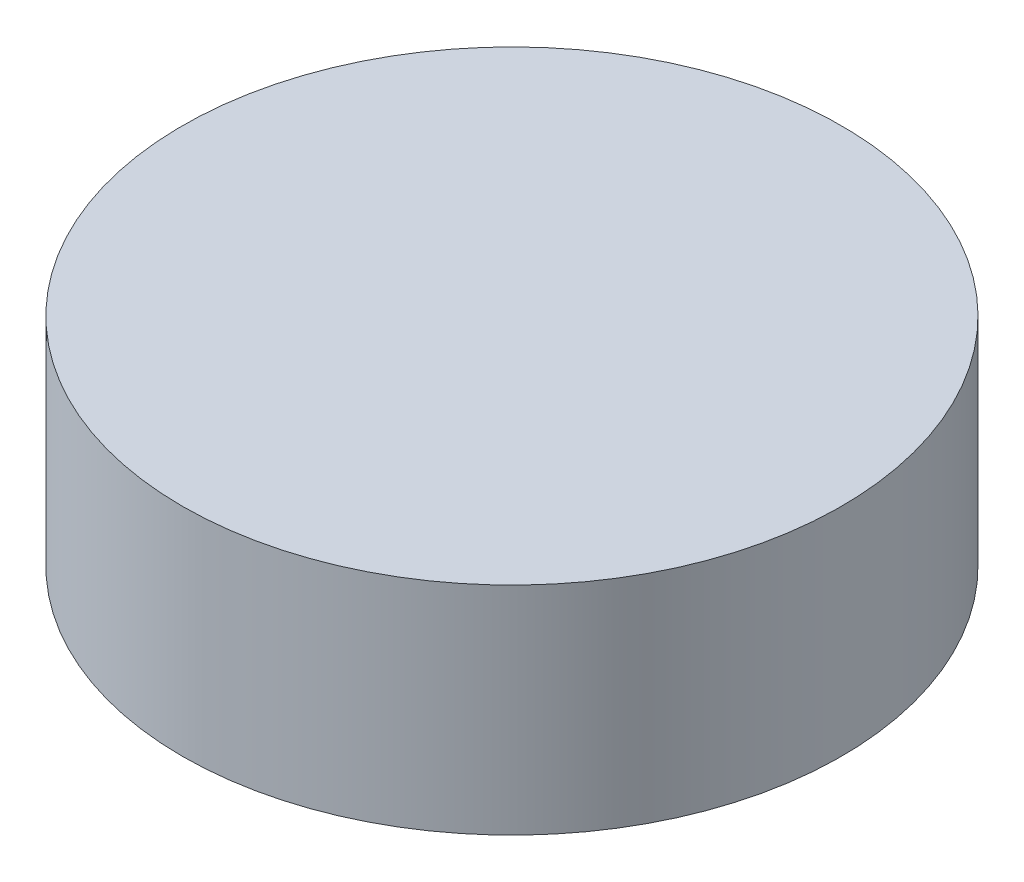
ISO-10303-21;
HEADER;
FILE_DESCRIPTION(('STEP AP214'),'2;1');
FILE_NAME('part.step','',(''),(''),'','','');
FILE_SCHEMA(('AUTOMOTIVE_DESIGN { 1 0 10303 214 1 1 1 1 }'));
ENDSEC;
DATA;
#1=APPLICATION_CONTEXT('core data for automotive mechanical design processes');
#2=APPLICATION_PROTOCOL_DEFINITION('international standard','automotive_design',2000,#1);
#3=PRODUCT_CONTEXT('',#1,'mechanical');
#4=PRODUCT('Part','Part','',(#3));
#5=PRODUCT_RELATED_PRODUCT_CATEGORY('part','',(#4));
#6=PRODUCT_DEFINITION_FORMATION('','',#4);
#7=PRODUCT_DEFINITION_CONTEXT('part definition',#1,'design');
#8=PRODUCT_DEFINITION('design','',#6,#7);
#9=PRODUCT_DEFINITION_SHAPE('','',#8);
#10=(LENGTH_UNIT() NAMED_UNIT(*) SI_UNIT(.MILLI.,.METRE.));
#11=(NAMED_UNIT(*) PLANE_ANGLE_UNIT() SI_UNIT($,.RADIAN.));
#12=(NAMED_UNIT(*) SI_UNIT($,.STERADIAN.) SOLID_ANGLE_UNIT());
#13=UNCERTAINTY_MEASURE_WITH_UNIT(LENGTH_MEASURE(1.E-05),#10,'distance_accuracy_value','');
#14=(GEOMETRIC_REPRESENTATION_CONTEXT(3) GLOBAL_UNCERTAINTY_ASSIGNED_CONTEXT((#13)) GLOBAL_UNIT_ASSIGNED_CONTEXT((#10,
#11,#12)) REPRESENTATION_CONTEXT('',''));
#15=CARTESIAN_POINT('',(0.,0.,0.));
#16=DIRECTION('',(0.,0.,1.));
#17=DIRECTION('',(1.,0.,0.));
#18=AXIS2_PLACEMENT_3D('',#15,#16,#17);
#19=CARTESIAN_POINT('',(0.,-2.921,0.));
#20=DIRECTION('',(0.,1.,0.));
#21=DIRECTION('',(0.,0.,1.));
#22=AXIS2_PLACEMENT_3D('',#19,#20,#21);
#23=CYLINDRICAL_SURFACE('',#22,8.89);
#24=CARTESIAN_POINT('',(0.,-2.921,0.));
#25=DIRECTION('',(0.,1.,0.));
#26=DIRECTION('',(0.,0.,1.));
#27=AXIS2_PLACEMENT_3D('',#24,#25,#26);
#28=CIRCLE('',#27,8.89);
#29=CARTESIAN_POINT('',(0.,-2.921,8.89));
#30=VERTEX_POINT('',#29);
#31=EDGE_CURVE('E10',#30,#30,#28,.T.);
#32=ORIENTED_EDGE('',*,*,#31,.T.);
#33=EDGE_LOOP('',(#32));
#34=FACE_BOUND('',#33,.T.);
#35=CARTESIAN_POINT('',(0.,2.921,0.));
#36=DIRECTION('',(0.,1.,0.));
#37=DIRECTION('',(0.,0.,1.));
#38=AXIS2_PLACEMENT_3D('',#35,#36,#37);
#39=CIRCLE('',#38,8.89);
#40=CARTESIAN_POINT('',(0.,2.921,8.89));
#41=VERTEX_POINT('',#40);
#42=EDGE_CURVE('E43',#41,#41,#39,.T.);
#43=ORIENTED_EDGE('',*,*,#42,.F.);
#44=EDGE_LOOP('',(#43));
#45=FACE_BOUND('',#44,.T.);
#46=ADVANCED_FACE('F40',(#34,#45),#23,.T.);
#47=CARTESIAN_POINT('',(0.,-2.921,0.));
#48=DIRECTION('',(0.,1.,0.));
#49=DIRECTION('',(0.,0.,1.));
#50=AXIS2_PLACEMENT_3D('',#47,#48,#49);
#51=PLANE('',#50);
#52=CARTESIAN_POINT('',(0.,-2.921,0.));
#53=DIRECTION('',(0.,-1.,0.));
#54=DIRECTION('',(0.,0.,-1.));
#55=AXIS2_PLACEMENT_3D('',#52,#53,#54);
#56=CIRCLE('',#55,3.81);
#57=CARTESIAN_POINT('',(0.,-2.921,-3.81));
#58=VERTEX_POINT('',#57);
#59=EDGE_CURVE('E54',#58,#58,#56,.T.);
#60=ORIENTED_EDGE('',*,*,#59,.F.);
#61=EDGE_LOOP('',(#60));
#62=FACE_BOUND('',#61,.T.);
#63=ORIENTED_EDGE('',*,*,#31,.F.);
#64=EDGE_LOOP('',(#63));
#65=FACE_BOUND('',#64,.T.);
#66=ADVANCED_FACE('F71',(#62,#65),#51,.F.);
#67=CARTESIAN_POINT('',(0.,2.921,0.));
#68=DIRECTION('',(0.,1.,0.));
#69=DIRECTION('',(0.,0.,1.));
#70=AXIS2_PLACEMENT_3D('',#67,#68,#69);
#71=PLANE('',#70);
#72=ORIENTED_EDGE('',*,*,#42,.T.);
#73=EDGE_LOOP('',(#72));
#74=FACE_BOUND('',#73,.T.);
#75=ADVANCED_FACE('F67',(#74),#71,.T.);
#76=CARTESIAN_POINT('',(0.,2.159,0.));
#77=DIRECTION('',(0.,-1.,0.));
#78=DIRECTION('',(0.,0.,-1.));
#79=AXIS2_PLACEMENT_3D('',#76,#77,#78);
#80=CYLINDRICAL_SURFACE('',#79,3.81);
#81=CARTESIAN_POINT('',(0.,2.159,0.));
#82=DIRECTION('',(0.,-1.,0.));
#83=DIRECTION('',(0.,0.,-1.));
#84=AXIS2_PLACEMENT_3D('',#81,#82,#83);
#85=CIRCLE('',#84,3.81);
#86=CARTESIAN_POINT('',(0.,2.159,-3.81));
#87=VERTEX_POINT('',#86);
#88=EDGE_CURVE('E52',#87,#87,#85,.T.);
#89=ORIENTED_EDGE('',*,*,#88,.F.);
#90=EDGE_LOOP('',(#89));
#91=FACE_BOUND('',#90,.T.);
#92=ORIENTED_EDGE('',*,*,#59,.T.);
#93=EDGE_LOOP('',(#92));
#94=FACE_BOUND('',#93,.T.);
#95=ADVANCED_FACE('F64',(#91,#94),#80,.F.);
#96=CARTESIAN_POINT('',(0.,2.159,0.));
#97=DIRECTION('',(0.,-1.,0.));
#98=DIRECTION('',(0.,0.,-1.));
#99=AXIS2_PLACEMENT_3D('',#96,#97,#98);
#100=PLANE('',#99);
#101=ORIENTED_EDGE('',*,*,#88,.T.);
#102=EDGE_LOOP('',(#101));
#103=FACE_BOUND('',#102,.T.);
#104=ADVANCED_FACE('F62',(#103),#100,.T.);
#105=CLOSED_SHELL('',(#46,#66,#75,#95,#104));
#106=MANIFOLD_SOLID_BREP('B2',#105);
#107=ADVANCED_BREP_SHAPE_REPRESENTATION('',(#18,#106),#14);
#108=SHAPE_DEFINITION_REPRESENTATION(#9,#107);
ENDSEC;
END-ISO-10303-21;
